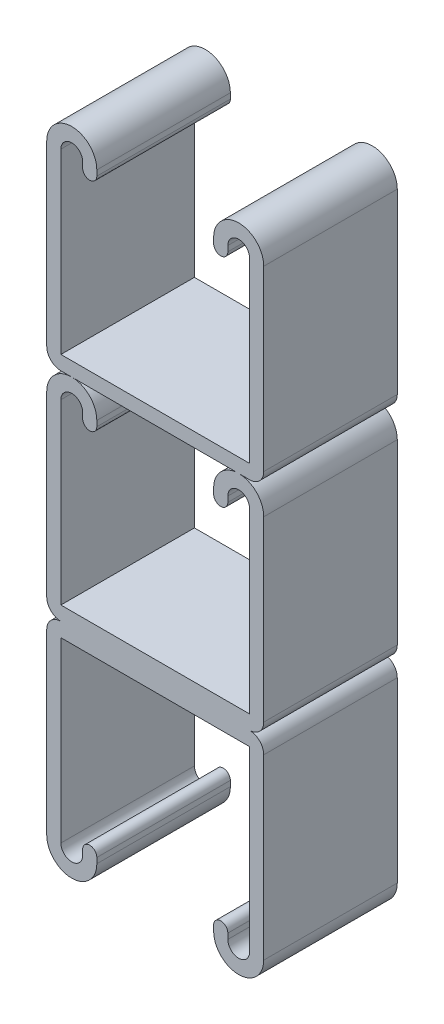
from build123d import *

# Parameters (mm, degrees)
BASE_EXTRUDE_DEPTH = 12.7
LPATTERN1_COUNT    = 2
LPATTERN1_PITCH    = 41.27246


with BuildPart() as part:
    # Sketch1 → Base-Extrude (new, symmetric)
    with BuildSketch(Plane.XY):
        with BuildLine():
            Line((-20.6375, 36.5125), (-20.6375, 2.6924))
            ThreePointArc((-20.6375, 2.6924), (-19.848914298, 0.788585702), (-17.9451, 0))
            Line((-17.9451, 0), (17.9451, 0))
            ThreePointArc((17.9451, 0), (19.848914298, 0.788585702), (20.6375, 2.6924))
            Line((20.6375, 2.6924), (20.6375, 36.5125))
            ThreePointArc((20.6375, 36.5125), (15.875, 41.275), (11.1125, 36.5125))
            Line((11.1125, 36.5125), (11.1125, 35.47745))
            ThreePointArc((11.1125, 35.47745), (12.4587, 34.13125), (13.8049, 35.47745))
            Line((13.8049, 35.47745), (13.8049, 36.5125))
            ThreePointArc((13.8049, 36.5125), (15.875, 38.5826), (17.9451, 36.5125))
            Line((17.9451, 36.5125), (17.9451, 2.6924))
            Line((17.9451, 2.6924), (-17.9451, 2.6924))
            Line((-17.9451, 2.6924), (-17.9451, 36.5125))
            ThreePointArc((-17.9451, 36.5125), (-15.875, 38.5826), (-13.8049, 36.5125))
            Line((-13.8049, 36.5125), (-13.8049, 35.47745))
            ThreePointArc((-13.8049, 35.47745), (-12.4587, 34.13125), (-11.1125, 35.47745))
            Line((-11.1125, 35.47745), (-11.1125, 36.5125))
            ThreePointArc((-11.1125, 36.5125), (-15.875, 41.275), (-20.6375, 36.5125))
        make_face()
    base_extrude = extrude(amount=BASE_EXTRUDE_DEPTH, both=True)

    # Mirror1: Base-Extrude across plane
    add(base_extrude.mirror(Plane.ZX))

    # LPattern1: Base-Extrude ×2
    with Locations(*[(0, i * LPATTERN1_PITCH, 0) for i in range(1, LPATTERN1_COUNT)]):
        add(base_extrude)


solid = part.part
